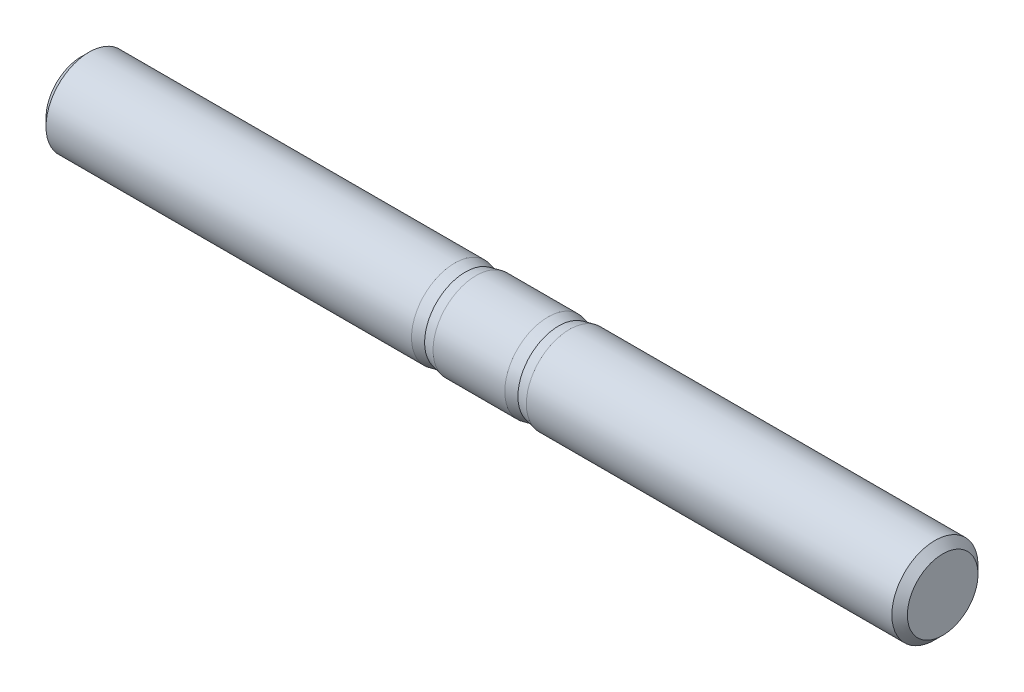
from build123d import *

# Parameters (mm, degrees)
HEADCHAMFER_SIZE = 0.2705


with BuildPart() as part:
    # Sketch1 → Base (revolve)
    with BuildSketch(Plane.XY, mode=Mode.PRIVATE) as base_sk:
        Polygon((0, 0), (0, 1.5), (13, 1.5), (13.75, 1.3375), (16.25, 1.3375), (17, 1.5), (30, 1.5), (30, 0), align=None)
    revolve(base_sk.sketch.rotate(Axis((-1.310841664, 0, 0), (1, 0, 0)), 90), axis=Axis((-1.310841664, 0, 0), (1, 0, 0)))

    # HeadChamfer
    headchamfer_edges = [part.edges().sort_by_distance(p)[0] for p in [
        (30, 0, -1.5),
        (0, 0, -1.5),
    ]]
    chamfer(headchamfer_edges, length=HEADCHAMFER_SIZE)

    # Sketch4 → BaseBody (revolve)
    with BuildSketch(Plane.XY, mode=Mode.PRIVATE) as basebody_sk:
        Polygon((13, 1.3375), (13.75, 1.5), (16.25, 1.5), (17, 1.3375), align=None)
    revolve(basebody_sk.sketch.rotate(Axis((-7.809086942, 0, 0), (1, 0, 0)), 90), axis=Axis((-7.809086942, 0, 0), (1, 0, 0)))


solid = part.part
